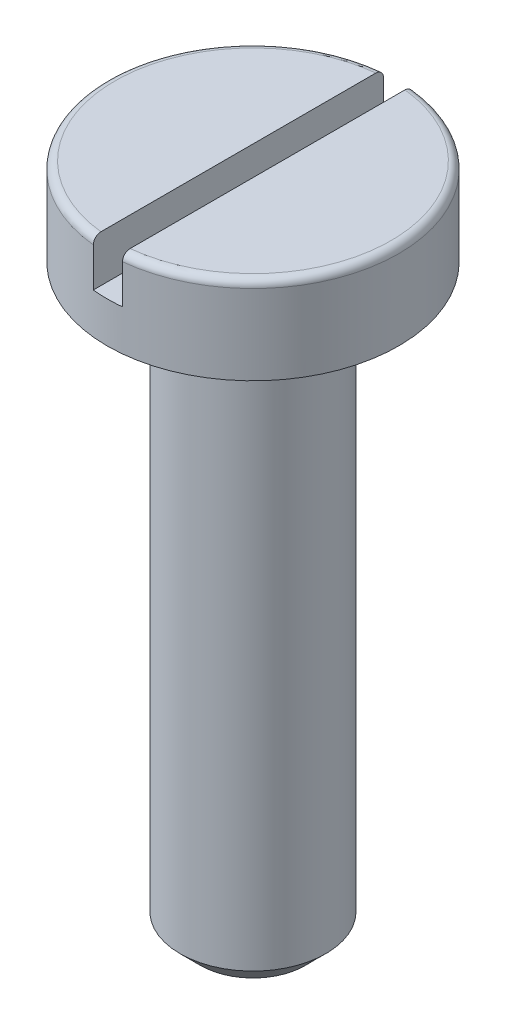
ISO-10303-21;
HEADER;
FILE_DESCRIPTION(('STEP AP214'),'2;1');
FILE_NAME('part.step','',(''),(''),'','','');
FILE_SCHEMA(('AUTOMOTIVE_DESIGN { 1 0 10303 214 1 1 1 1 }'));
ENDSEC;
DATA;
#1=APPLICATION_CONTEXT('core data for automotive mechanical design processes');
#2=APPLICATION_PROTOCOL_DEFINITION('international standard','automotive_design',2000,#1);
#3=PRODUCT_CONTEXT('',#1,'mechanical');
#4=PRODUCT('Part','Part','',(#3));
#5=PRODUCT_RELATED_PRODUCT_CATEGORY('part','',(#4));
#6=PRODUCT_DEFINITION_FORMATION('','',#4);
#7=PRODUCT_DEFINITION_CONTEXT('part definition',#1,'design');
#8=PRODUCT_DEFINITION('design','',#6,#7);
#9=PRODUCT_DEFINITION_SHAPE('','',#8);
#10=(LENGTH_UNIT() NAMED_UNIT(*) SI_UNIT(.MILLI.,.METRE.));
#11=(NAMED_UNIT(*) PLANE_ANGLE_UNIT() SI_UNIT($,.RADIAN.));
#12=(NAMED_UNIT(*) SI_UNIT($,.STERADIAN.) SOLID_ANGLE_UNIT());
#13=UNCERTAINTY_MEASURE_WITH_UNIT(LENGTH_MEASURE(1.E-05),#10,'distance_accuracy_value','');
#14=(GEOMETRIC_REPRESENTATION_CONTEXT(3) GLOBAL_UNCERTAINTY_ASSIGNED_CONTEXT((#13)) GLOBAL_UNIT_ASSIGNED_CONTEXT((#10,
#11,#12)) REPRESENTATION_CONTEXT('',''));
#15=CARTESIAN_POINT('',(0.,0.,0.));
#16=DIRECTION('',(0.,0.,1.));
#17=DIRECTION('',(1.,0.,0.));
#18=AXIS2_PLACEMENT_3D('',#15,#16,#17);
#19=CARTESIAN_POINT('',(0.,1.5,0.));
#20=DIRECTION('',(0.,-1.,0.));
#21=DIRECTION('',(0.,0.,-1.));
#22=AXIS2_PLACEMENT_3D('',#19,#20,#21);
#23=PLANE('',#22);
#24=CARTESIAN_POINT('',(0.,1.5,0.));
#25=DIRECTION('',(0.,1.,0.));
#26=DIRECTION('',(0.,0.,1.));
#27=AXIS2_PLACEMENT_3D('',#24,#25,#26);
#28=CIRCLE('',#27,2.37);
#29=CARTESIAN_POINT('',(-0.25,1.5,-2.35677746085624));
#30=VERTEX_POINT('',#29);
#31=CARTESIAN_POINT('',(-0.25,1.5,2.35677746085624));
#32=VERTEX_POINT('',#31);
#33=EDGE_CURVE('E96',#30,#32,#28,.T.);
#34=ORIENTED_EDGE('',*,*,#33,.T.);
#35=DIRECTION('',(0.,0.,1.));
#36=VECTOR('',#35,1.);
#37=CARTESIAN_POINT('',(-0.25,1.5,-2.5));
#38=LINE('',#37,#36);
#39=EDGE_CURVE('E87',#30,#32,#38,.T.);
#40=ORIENTED_EDGE('',*,*,#39,.F.);
#41=EDGE_LOOP('',(#34,#40));
#42=FACE_BOUND('',#41,.T.);
#43=ADVANCED_FACE('F33',(#42),#23,.F.);
#44=CARTESIAN_POINT('',(0.,1.37,0.));
#45=DIRECTION('',(0.,1.,0.));
#46=DIRECTION('',(0.,0.,1.));
#47=AXIS2_PLACEMENT_3D('',#44,#45,#46);
#48=TOROIDAL_SURFACE('',#47,2.37,0.13);
#49=ORIENTED_EDGE('',*,*,#33,.F.);
#50=CARTESIAN_POINT('',(-0.25,1.43911937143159,-2.46746982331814));
#51=CARTESIAN_POINT('',(-0.25,1.43296494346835,-2.47135281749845));
#52=CARTESIAN_POINT('',(-0.25,1.42647907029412,-2.47472015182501));
#53=CARTESIAN_POINT('',(-0.25,1.41302891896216,-2.48032132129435));
#54=CARTESIAN_POINT('',(-0.25,1.40606409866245,-2.4825538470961));
#55=CARTESIAN_POINT('',(-0.25,1.39186015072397,-2.48581591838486));
#56=CARTESIAN_POINT('',(-0.25,1.38462112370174,-2.48684590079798));
#57=CARTESIAN_POINT('',(-0.25,1.37007485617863,-2.48767352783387));
#58=CARTESIAN_POINT('',(-0.25,1.36276763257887,-2.48747147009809));
#59=CARTESIAN_POINT('',(-0.25,1.34830107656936,-2.48584291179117));
#60=CARTESIAN_POINT('',(-0.25,1.34114155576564,-2.48441808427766));
#61=CARTESIAN_POINT('',(-0.25,1.32716277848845,-2.48038766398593));
#62=CARTESIAN_POINT('',(-0.25,1.32034353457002,-2.47778202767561));
#63=CARTESIAN_POINT('',(-0.25,1.30723188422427,-2.47146272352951));
#64=CARTESIAN_POINT('',(-0.25,1.30093995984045,-2.46774805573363));
#65=CARTESIAN_POINT('',(-0.25,1.28906611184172,-2.45931875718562));
#66=CARTESIAN_POINT('',(-0.25,1.2834841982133,-2.45460411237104));
#67=CARTESIAN_POINT('',(-0.25,1.27316640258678,-2.44429081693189));
#68=CARTESIAN_POINT('',(-0.25,1.26843369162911,-2.43868899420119));
#69=CARTESIAN_POINT('',(-0.25,1.25997030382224,-2.4267736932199));
#70=CARTESIAN_POINT('',(-0.25,1.25623965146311,-2.42046019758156));
#71=CARTESIAN_POINT('',(-0.25,1.24986634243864,-2.40726673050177));
#72=CARTESIAN_POINT('',(-0.25,1.24722926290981,-2.40038406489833));
#73=CARTESIAN_POINT('',(-0.25,1.24314226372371,-2.38627484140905));
#74=CARTESIAN_POINT('',(-0.25,1.24169237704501,-2.37904827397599));
#75=CARTESIAN_POINT('',(-0.25,1.24001521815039,-2.36442203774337));
#76=CARTESIAN_POINT('',(-0.25,1.23979340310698,-2.35702174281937));
#77=CARTESIAN_POINT('',(-0.25,1.24059274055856,-2.34228852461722));
#78=CARTESIAN_POINT('',(-0.25,1.24161391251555,-2.33495560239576));
#79=CARTESIAN_POINT('',(-0.25,1.24487407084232,-2.32055094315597));
#80=CARTESIAN_POINT('',(-0.25,1.24711535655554,-2.31347972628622));
#81=CARTESIAN_POINT('',(-0.25,1.2527552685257,-2.29981484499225));
#82=CARTESIAN_POINT('',(-0.25,1.25615389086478,-2.2932211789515));
#83=CARTESIAN_POINT('',(-0.25,1.26400708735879,-2.28071187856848));
#84=CARTESIAN_POINT('',(-0.25,1.26845980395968,-2.27479507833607));
#85=CARTESIAN_POINT('',(-0.25,1.27829987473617,-2.26379762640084));
#86=CARTESIAN_POINT('',(-0.25,1.28368720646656,-2.25871695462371));
#87=CARTESIAN_POINT('',(-0.25,1.2952158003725,-2.24956319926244));
#88=CARTESIAN_POINT('',(-0.25,1.30135323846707,-2.24548529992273));
#89=CARTESIAN_POINT('',(-0.25,1.31422883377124,-2.23842492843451));
#90=CARTESIAN_POINT('',(-0.25,1.32096697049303,-2.23544241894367));
#91=CARTESIAN_POINT('',(-0.25,1.3348099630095,-2.23067557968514));
#92=CARTESIAN_POINT('',(-0.25,1.34191242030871,-2.22888428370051));
#93=CARTESIAN_POINT('',(-0.25,1.3563176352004,-2.22652489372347));
#94=CARTESIAN_POINT('',(-0.25,1.36362038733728,-2.22595676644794));
#95=CARTESIAN_POINT('',(-0.25,1.37818766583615,-2.22606033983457));
#96=CARTESIAN_POINT('',(-0.25,1.38545222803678,-2.22672707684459));
#97=CARTESIAN_POINT('',(-0.25,1.39976615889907,-2.22927090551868));
#98=CARTESIAN_POINT('',(-0.25,1.40681552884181,-2.23114798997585));
#99=CARTESIAN_POINT('',(-0.25,1.42049920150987,-2.23605713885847));
#100=CARTESIAN_POINT('',(-0.25,1.42713353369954,-2.23908912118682));
#101=CARTESIAN_POINT('',(-0.25,1.43980169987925,-2.24621970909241));
#102=CARTESIAN_POINT('',(-0.25,1.44583552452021,-2.25031833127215));
#103=CARTESIAN_POINT('',(-0.25,1.45715719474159,-2.25948194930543));
#104=CARTESIAN_POINT('',(-0.25,1.46244205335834,-2.26455063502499));
#105=CARTESIAN_POINT('',(-0.25,1.4720918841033,-2.27549874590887));
#106=CARTESIAN_POINT('',(-0.25,1.47645682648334,-2.28137819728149));
#107=CARTESIAN_POINT('',(-0.25,1.48416996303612,-2.29381777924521));
#108=CARTESIAN_POINT('',(-0.25,1.48751205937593,-2.30038169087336));
#109=CARTESIAN_POINT('',(-0.25,1.49305316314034,-2.31397547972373));
#110=CARTESIAN_POINT('',(-0.25,1.49525213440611,-2.32100537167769));
#111=CARTESIAN_POINT('',(-0.25,1.498454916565,-2.33536951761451));
#112=CARTESIAN_POINT('',(-0.25,1.49945266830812,-2.34270512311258));
#113=CARTESIAN_POINT('',(-0.25,1.50020513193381,-2.357439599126));
#114=CARTESIAN_POINT('',(-0.25,1.49995987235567,-2.36483846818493));
#115=CARTESIAN_POINT('',(-0.25,1.49823112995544,-2.37950421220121));
#116=CARTESIAN_POINT('',(-0.25,1.4967453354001,-2.38677081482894));
#117=CARTESIAN_POINT('',(-0.25,1.49257232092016,-2.40095268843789));
#118=CARTESIAN_POINT('',(-0.25,1.48988480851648,-2.40786787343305));
#119=CARTESIAN_POINT('',(-0.25,1.48338728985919,-2.42113804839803));
#120=CARTESIAN_POINT('',(-0.25,1.47957864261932,-2.42749370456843));
#121=CARTESIAN_POINT('',(-0.25,1.47094630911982,-2.43946569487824));
#122=CARTESIAN_POINT('',(-0.25,1.46612387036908,-2.44508292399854));
#123=CARTESIAN_POINT('',(-0.25,1.45756075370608,-2.45349644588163));
#124=CARTESIAN_POINT('',(-0.25,1.45408360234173,-2.45656555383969));
#125=CARTESIAN_POINT('',(-0.25,1.44682221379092,-2.46231606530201));
#126=CARTESIAN_POINT('',(-0.25,1.44303797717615,-2.464997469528));
#127=CARTESIAN_POINT('',(-0.25,1.43911937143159,-2.46746982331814));
#128=B_SPLINE_CURVE_WITH_KNOTS('',3,(#50,#51,#52,#53,#54,#55,#56,#57,#58,#59,#60,#61,#62,#63,
#64,#65,#66,#67,#68,#69,#70,#71,#72,#73,#74,#75,#76,#77,#78,#79,#80,#81,#82,#83,#84,#85,#86,#87,
#88,#89,#90,#91,#92,#93,#94,#95,#96,#97,#98,#99,#100,#101,#102,#103,#104,#105,#106,#107,#108,
#109,#110,#111,#112,#113,#114,#115,#116,#117,#118,#119,#120,#121,#122,#123,#124,#125,#126,#127),
.UNSPECIFIED.,.T.,.F.,(4,2,2,2,2,2,2,2,2,2,2,2,2,2,2,2,2,2,2,2,2,2,2,2,2,2,2,2,2,2,2,2,2,2,2,2,
2,2,4),(0.,0.0218141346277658,0.0436533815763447,0.0654846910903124,0.0873107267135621,
0.109106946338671,0.130903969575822,0.152720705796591,0.174537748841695,0.196434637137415,
0.218332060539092,0.240339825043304,0.262348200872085,0.284454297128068,0.306560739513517,
0.328708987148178,0.350857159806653,0.372966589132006,0.395075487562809,0.417076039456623,
0.439075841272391,0.460945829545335,0.482815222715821,0.504596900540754,0.526378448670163,
0.548158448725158,0.569938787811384,0.591803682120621,0.613669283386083,0.635662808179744,
0.65765702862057,0.679761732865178,0.70186592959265,0.724011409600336,0.746162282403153,
0.768286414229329,0.790383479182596,0.804272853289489,0.818162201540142),.UNSPECIFIED.);
#129=CARTESIAN_POINT('',(-0.25,1.36999999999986,-2.48746859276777));
#130=VERTEX_POINT('',#129);
#131=EDGE_CURVE('E84',#30,#130,#128,.T.);
#132=ORIENTED_EDGE('',*,*,#131,.T.);
#133=CARTESIAN_POINT('',(0.,1.37,0.));
#134=DIRECTION('',(0.,1.,0.));
#135=DIRECTION('',(0.,0.,1.));
#136=AXIS2_PLACEMENT_3D('',#133,#134,#135);
#137=CIRCLE('',#136,2.5);
#138=CARTESIAN_POINT('',(-0.25,1.37000000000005,2.48746859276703));
#139=VERTEX_POINT('',#138);
#140=EDGE_CURVE('E103',#130,#139,#137,.T.);
#141=ORIENTED_EDGE('',*,*,#140,.T.);
#142=CARTESIAN_POINT('',(-0.25,1.42827001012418,2.23988223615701));
#143=CARTESIAN_POINT('',(-0.25,1.42178303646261,2.23660967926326));
#144=CARTESIAN_POINT('',(-0.25,1.41501584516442,2.23388116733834));
#145=CARTESIAN_POINT('',(-0.25,1.40111402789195,2.22959648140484));
#146=CARTESIAN_POINT('',(-0.25,1.39397899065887,2.2280416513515));
#147=CARTESIAN_POINT('',(-0.25,1.37955103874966,2.22615388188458));
#148=CARTESIAN_POINT('',(-0.25,1.37225818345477,2.22582049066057));
#149=CARTESIAN_POINT('',(-0.25,1.35772216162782,2.22638464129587));
#150=CARTESIAN_POINT('',(-0.25,1.35047898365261,2.22728188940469));
#151=CARTESIAN_POINT('',(-0.25,1.33625385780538,2.23027853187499));
#152=CARTESIAN_POINT('',(-0.25,1.32927164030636,2.23237664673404));
#153=CARTESIAN_POINT('',(-0.25,1.31575706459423,2.23771263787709));
#154=CARTESIAN_POINT('',(-0.25,1.30922472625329,2.24095056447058));
#155=CARTESIAN_POINT('',(-0.25,1.2967779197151,2.24848114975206));
#156=CARTESIAN_POINT('',(-0.25,1.29086497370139,2.25277632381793));
#157=CARTESIAN_POINT('',(-0.25,1.27983920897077,2.2622934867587));
#158=CARTESIAN_POINT('',(-0.25,1.27472641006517,2.26751549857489));
#159=CARTESIAN_POINT('',(-0.25,1.26541640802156,2.27876789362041));
#160=CARTESIAN_POINT('',(-0.25,1.26122427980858,2.28480247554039));
#161=CARTESIAN_POINT('',(-0.25,1.25390591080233,2.29748658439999));
#162=CARTESIAN_POINT('',(-0.25,1.25077970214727,2.30413612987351));
#163=CARTESIAN_POINT('',(-0.25,1.24566392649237,2.31790205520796));
#164=CARTESIAN_POINT('',(-0.25,1.24368091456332,2.32502087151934));
#165=CARTESIAN_POINT('',(-0.25,1.24093365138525,2.33948996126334));
#166=CARTESIAN_POINT('',(-0.25,1.2401694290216,2.34684024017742));
#167=CARTESIAN_POINT('',(-0.25,1.2398805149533,2.36159008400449));
#168=CARTESIAN_POINT('',(-0.25,1.24036001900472,2.36898973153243));
#169=CARTESIAN_POINT('',(-0.25,1.24255472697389,2.3836035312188));
#170=CARTESIAN_POINT('',(-0.25,1.24426993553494,2.39081768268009));
#171=CARTESIAN_POINT('',(-0.25,1.24888858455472,2.40485327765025));
#172=CARTESIAN_POINT('',(-0.25,1.25179174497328,2.41167481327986));
#173=CARTESIAN_POINT('',(-0.25,1.25870596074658,2.4247312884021));
#174=CARTESIAN_POINT('',(-0.25,1.26271699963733,2.43096623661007));
#175=CARTESIAN_POINT('',(-0.25,1.27171897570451,2.44264879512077));
#176=CARTESIAN_POINT('',(-0.25,1.27670646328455,2.448099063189));
#177=CARTESIAN_POINT('',(-0.25,1.28752981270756,2.45807967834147));
#178=CARTESIAN_POINT('',(-0.25,1.29336565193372,2.46261004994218));
#179=CARTESIAN_POINT('',(-0.25,1.30568850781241,2.47059795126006));
#180=CARTESIAN_POINT('',(-0.25,1.31217209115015,2.47406077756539));
#181=CARTESIAN_POINT('',(-0.25,1.32563049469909,2.47984309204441));
#182=CARTESIAN_POINT('',(-0.25,1.33260530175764,2.48216261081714));
#183=CARTESIAN_POINT('',(-0.25,1.34681431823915,2.48558233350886));
#184=CARTESIAN_POINT('',(-0.25,1.35404721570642,2.48668799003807));
#185=CARTESIAN_POINT('',(-0.25,1.36859587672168,2.48766627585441));
#186=CARTESIAN_POINT('',(-0.25,1.37591163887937,2.48753892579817));
#187=CARTESIAN_POINT('',(-0.25,1.39040100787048,2.48605665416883));
#188=CARTESIAN_POINT('',(-0.25,1.39757489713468,2.48470449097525));
#189=CARTESIAN_POINT('',(-0.25,1.41159411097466,2.48081590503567));
#190=CARTESIAN_POINT('',(-0.25,1.41843943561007,2.47827948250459));
#191=CARTESIAN_POINT('',(-0.25,1.43161392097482,2.47209342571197));
#192=CARTESIAN_POINT('',(-0.25,1.43794264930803,2.46844287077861));
#193=CARTESIAN_POINT('',(-0.25,1.44990025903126,2.46013466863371));
#194=CARTESIAN_POINT('',(-0.25,1.4555291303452,2.45547700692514));
#195=CARTESIAN_POINT('',(-0.25,1.4659494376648,2.44526952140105));
#196=CARTESIAN_POINT('',(-0.25,1.47073779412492,2.43971655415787));
#197=CARTESIAN_POINT('',(-0.25,1.47931984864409,2.42788895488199));
#198=CARTESIAN_POINT('',(-0.25,1.4831135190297,2.42161430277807));
#199=CARTESIAN_POINT('',(-0.25,1.48961873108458,2.40848775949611));
#200=CARTESIAN_POINT('',(-0.25,1.49232474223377,2.40163312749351));
#201=CARTESIAN_POINT('',(-0.25,1.49655338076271,2.38756806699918));
#202=CARTESIAN_POINT('',(-0.25,1.49807597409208,2.38035762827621));
#203=CARTESIAN_POINT('',(-0.25,1.49990072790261,2.36575085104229));
#204=CARTESIAN_POINT('',(-0.25,1.50019735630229,2.35835382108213));
#205=CARTESIAN_POINT('',(-0.25,1.49954724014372,2.34361481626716));
#206=CARTESIAN_POINT('',(-0.25,1.49860052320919,2.33627284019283));
#207=CARTESIAN_POINT('',(-0.25,1.49548711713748,2.32183769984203));
#208=CARTESIAN_POINT('',(-0.25,1.49331813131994,2.31474503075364));
#209=CARTESIAN_POINT('',(-0.25,1.48781759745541,2.30102344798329));
#210=CARTESIAN_POINT('',(-0.25,1.48448576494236,2.29439464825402));
#211=CARTESIAN_POINT('',(-0.25,1.47675756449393,2.28180103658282));
#212=CARTESIAN_POINT('',(-0.25,1.47236243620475,2.27583546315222));
#213=CARTESIAN_POINT('',(-0.25,1.46263145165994,2.26473715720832));
#214=CARTESIAN_POINT('',(-0.25,1.45729675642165,2.25960341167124));
#215=CARTESIAN_POINT('',(-0.25,1.44797002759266,2.25204072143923));
#216=CARTESIAN_POINT('',(-0.25,1.44421445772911,2.24931504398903));
#217=CARTESIAN_POINT('',(-0.25,1.43643395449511,2.24427982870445));
#218=CARTESIAN_POINT('',(-0.25,1.43240902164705,2.24197029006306));
#219=CARTESIAN_POINT('',(-0.25,1.42827001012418,2.23988223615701));
#220=B_SPLINE_CURVE_WITH_KNOTS('',3,(#142,#143,#144,#145,#146,#147,#148,#149,#150,#151,#152,
#153,#154,#155,#156,#157,#158,#159,#160,#161,#162,#163,#164,#165,#166,#167,#168,#169,#170,#171,
#172,#173,#174,#175,#176,#177,#178,#179,#180,#181,#182,#183,#184,#185,#186,#187,#188,#189,#190,
#191,#192,#193,#194,#195,#196,#197,#198,#199,#200,#201,#202,#203,#204,#205,#206,#207,#208,#209,
#210,#211,#212,#213,#214,#215,#216,#217,#218,#219),.UNSPECIFIED.,.T.,.F.,(4,2,2,2,2,2,2,2,2,2,2,
2,2,2,2,2,2,2,2,2,2,2,2,2,2,2,2,2,2,2,2,2,2,2,2,2,2,2,4),(0.,0.0217802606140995,
0.0435854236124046,0.0653825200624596,0.0871744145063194,0.108943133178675,0.130712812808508,
0.152534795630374,0.17435731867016,0.196297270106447,0.218237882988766,0.240303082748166,
0.262368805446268,0.284509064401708,0.306649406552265,0.328784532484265,0.350919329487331,
0.372977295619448,0.395034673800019,0.416980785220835,0.438926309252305,0.460772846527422,
0.48261901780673,0.504416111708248,0.526213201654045,0.548028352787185,0.569843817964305,
0.591737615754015,0.61363202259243,0.635636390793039,0.657641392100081,0.679745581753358,
0.701849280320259,0.723994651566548,0.746145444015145,0.76827053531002,0.790368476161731,
0.804265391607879,0.818162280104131),.UNSPECIFIED.);
#221=EDGE_CURVE('E93',#139,#32,#220,.T.);
#222=ORIENTED_EDGE('',*,*,#221,.T.);
#223=EDGE_LOOP('',(#49,#132,#141,#222));
#224=FACE_BOUND('',#223,.T.);
#225=ADVANCED_FACE('F99',(#224),#48,.T.);
#226=CARTESIAN_POINT('',(0.,-10.,0.));
#227=DIRECTION('',(0.,1.,0.));
#228=DIRECTION('',(0.,0.,1.));
#229=AXIS2_PLACEMENT_3D('',#226,#227,#228);
#230=CYLINDRICAL_SURFACE('',#229,1.25);
#231=CARTESIAN_POINT('',(0.,-9.64999999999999,0.));
#232=DIRECTION('',(0.,1.,0.));
#233=DIRECTION('',(0.,0.,1.));
#234=AXIS2_PLACEMENT_3D('',#231,#232,#233);
#235=CIRCLE('',#234,1.25);
#236=CARTESIAN_POINT('',(0.,-9.64999999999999,1.25));
#237=VERTEX_POINT('',#236);
#238=EDGE_CURVE('E116',#237,#237,#235,.T.);
#239=ORIENTED_EDGE('',*,*,#238,.T.);
#240=EDGE_LOOP('',(#239));
#241=FACE_BOUND('',#240,.T.);
#242=CARTESIAN_POINT('',(0.,0.,0.));
#243=DIRECTION('',(0.,1.,0.));
#244=DIRECTION('',(0.,0.,1.));
#245=AXIS2_PLACEMENT_3D('',#242,#243,#244);
#246=CIRCLE('',#245,1.25);
#247=CARTESIAN_POINT('',(0.,0.,1.25));
#248=VERTEX_POINT('',#247);
#249=EDGE_CURVE('E113',#248,#248,#246,.T.);
#250=ORIENTED_EDGE('',*,*,#249,.F.);
#251=EDGE_LOOP('',(#250));
#252=FACE_BOUND('',#251,.T.);
#253=ADVANCED_FACE('F184',(#241,#252),#230,.T.);
#254=CARTESIAN_POINT('',(0.,-10.,0.));
#255=DIRECTION('',(0.,1.,0.));
#256=DIRECTION('',(0.,0.,1.));
#257=AXIS2_PLACEMENT_3D('',#254,#255,#256);
#258=PLANE('',#257);
#259=CARTESIAN_POINT('',(0.,-10.,0.));
#260=DIRECTION('',(0.,1.,0.));
#261=DIRECTION('',(0.,0.,1.));
#262=AXIS2_PLACEMENT_3D('',#259,#260,#261);
#263=CIRCLE('',#262,0.899999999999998);
#264=CARTESIAN_POINT('',(0.,-10.,0.899999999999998));
#265=VERTEX_POINT('',#264);
#266=EDGE_CURVE('E119',#265,#265,#263,.F.);
#267=ORIENTED_EDGE('',*,*,#266,.T.);
#268=EDGE_LOOP('',(#267));
#269=FACE_BOUND('',#268,.T.);
#270=ADVANCED_FACE('F194',(#269),#258,.F.);
#271=CARTESIAN_POINT('',(0.,-9.64999999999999,0.));
#272=DIRECTION('',(0.,1.,0.));
#273=DIRECTION('',(0.,0.,1.));
#274=AXIS2_PLACEMENT_3D('',#271,#272,#273);
#275=CONICAL_SURFACE('',#274,1.25,0.785398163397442);
#276=ORIENTED_EDGE('',*,*,#266,.F.);
#277=EDGE_LOOP('',(#276));
#278=FACE_BOUND('',#277,.T.);
#279=ORIENTED_EDGE('',*,*,#238,.F.);
#280=EDGE_LOOP('',(#279));
#281=FACE_BOUND('',#280,.T.);
#282=ADVANCED_FACE('F35',(#278,#281),#275,.T.);
#283=CARTESIAN_POINT('',(0.25,1.5,2.35677746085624));
#284=VERTEX_POINT('',#283);
#285=CARTESIAN_POINT('',(0.25,1.5,-2.35677746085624));
#286=VERTEX_POINT('',#285);
#287=EDGE_CURVE('E100',#284,#286,#28,.T.);
#288=ORIENTED_EDGE('',*,*,#287,.T.);
#289=DIRECTION('',(0.,0.,-1.));
#290=VECTOR('',#289,1.);
#291=CARTESIAN_POINT('',(0.25,1.5,-2.5));
#292=LINE('',#291,#290);
#293=EDGE_CURVE('E97',#284,#286,#292,.T.);
#294=ORIENTED_EDGE('',*,*,#293,.F.);
#295=EDGE_LOOP('',(#288,#294));
#296=FACE_BOUND('',#295,.T.);
#297=ADVANCED_FACE('F158',(#296),#23,.F.);
#298=CARTESIAN_POINT('',(0.,0.,0.));
#299=DIRECTION('',(0.,1.,0.));
#300=DIRECTION('',(0.,0.,1.));
#301=AXIS2_PLACEMENT_3D('',#298,#299,#300);
#302=PLANE('',#301);
#303=ORIENTED_EDGE('',*,*,#249,.T.);
#304=EDGE_LOOP('',(#303));
#305=FACE_BOUND('',#304,.T.);
#306=CARTESIAN_POINT('',(0.,0.,0.));
#307=DIRECTION('',(0.,1.,0.));
#308=DIRECTION('',(0.,0.,1.));
#309=AXIS2_PLACEMENT_3D('',#306,#307,#308);
#310=CIRCLE('',#309,2.5);
#311=CARTESIAN_POINT('',(0.,0.,2.5));
#312=VERTEX_POINT('',#311);
#313=EDGE_CURVE('E110',#312,#312,#310,.T.);
#314=ORIENTED_EDGE('',*,*,#313,.F.);
#315=EDGE_LOOP('',(#314));
#316=FACE_BOUND('',#315,.T.);
#317=ADVANCED_FACE('F188',(#305,#316),#302,.F.);
#318=CARTESIAN_POINT('',(0.,1.3,0.));
#319=DIRECTION('',(0.,1.,0.));
#320=DIRECTION('',(0.,0.,1.));
#321=AXIS2_PLACEMENT_3D('',#318,#319,#320);
#322=CYLINDRICAL_SURFACE('',#321,2.5);
#323=ORIENTED_EDGE('',*,*,#140,.F.);
#324=DIRECTION('',(0.,1.,0.));
#325=VECTOR('',#324,1.);
#326=CARTESIAN_POINT('',(-0.25,1.3,-2.48746859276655));
#327=LINE('',#326,#325);
#328=CARTESIAN_POINT('',(-0.25,0.7,-2.48746859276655));
#329=VERTEX_POINT('',#328);
#330=EDGE_CURVE('E56',#130,#329,#327,.F.);
#331=ORIENTED_EDGE('',*,*,#330,.T.);
#332=CARTESIAN_POINT('',(0.,0.7,0.));
#333=DIRECTION('',(0.,1.,0.));
#334=DIRECTION('',(0.,0.,1.));
#335=AXIS2_PLACEMENT_3D('',#332,#333,#334);
#336=CIRCLE('',#335,2.5);
#337=CARTESIAN_POINT('',(0.25,0.7,-2.48746859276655));
#338=VERTEX_POINT('',#337);
#339=EDGE_CURVE('E11',#338,#329,#336,.T.);
#340=ORIENTED_EDGE('',*,*,#339,.F.);
#341=DIRECTION('',(0.,1.,0.));
#342=VECTOR('',#341,1.);
#343=CARTESIAN_POINT('',(0.25,1.3,-2.48746859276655));
#344=LINE('',#343,#342);
#345=CARTESIAN_POINT('',(0.25,1.37,-2.48746859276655));
#346=VERTEX_POINT('',#345);
#347=EDGE_CURVE('E167',#338,#346,#344,.T.);
#348=ORIENTED_EDGE('',*,*,#347,.T.);
#349=CARTESIAN_POINT('',(0.25,1.37,2.48746859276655));
#350=VERTEX_POINT('',#349);
#351=EDGE_CURVE('E109',#350,#346,#137,.T.);
#352=ORIENTED_EDGE('',*,*,#351,.F.);
#353=DIRECTION('',(0.,1.,0.));
#354=VECTOR('',#353,1.);
#355=CARTESIAN_POINT('',(0.25,1.3,2.48746859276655));
#356=LINE('',#355,#354);
#357=CARTESIAN_POINT('',(0.25,0.7,2.48746859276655));
#358=VERTEX_POINT('',#357);
#359=EDGE_CURVE('E48',#350,#358,#356,.F.);
#360=ORIENTED_EDGE('',*,*,#359,.T.);
#361=CARTESIAN_POINT('',(-0.25,0.7,2.48746859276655));
#362=VERTEX_POINT('',#361);
#363=EDGE_CURVE('E37',#362,#358,#336,.T.);
#364=ORIENTED_EDGE('',*,*,#363,.F.);
#365=DIRECTION('',(0.,1.,0.));
#366=VECTOR('',#365,1.);
#367=CARTESIAN_POINT('',(-0.25,1.3,2.48746859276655));
#368=LINE('',#367,#366);
#369=EDGE_CURVE('E104',#362,#139,#368,.T.);
#370=ORIENTED_EDGE('',*,*,#369,.T.);
#371=EDGE_LOOP('',(#323,#331,#340,#348,#352,#360,#364,#370));
#372=FACE_BOUND('',#371,.T.);
#373=ORIENTED_EDGE('',*,*,#313,.T.);
#374=EDGE_LOOP('',(#373));
#375=FACE_BOUND('',#374,.T.);
#376=ADVANCED_FACE('F171',(#372,#375),#322,.T.);
#377=ORIENTED_EDGE('',*,*,#351,.T.);
#378=CARTESIAN_POINT('',(0.25,1.43911937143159,-2.46746982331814));
#379=CARTESIAN_POINT('',(0.25,1.44531290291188,-2.4635613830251));
#380=CARTESIAN_POINT('',(0.25,1.45117973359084,-2.45912493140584));
#381=CARTESIAN_POINT('',(0.25,1.46208885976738,-2.44932494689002));
#382=CARTESIAN_POINT('',(0.25,1.46713010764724,-2.44396025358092));
#383=CARTESIAN_POINT('',(0.25,1.47623837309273,-2.43246478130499));
#384=CARTESIAN_POINT('',(0.25,1.48030606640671,-2.42633453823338));
#385=CARTESIAN_POINT('',(0.25,1.48735776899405,-2.41348197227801));
#386=CARTESIAN_POINT('',(0.25,1.49034204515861,-2.40675979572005));
#387=CARTESIAN_POINT('',(0.25,1.49515638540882,-2.39288535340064));
#388=CARTESIAN_POINT('',(0.25,1.49698200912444,-2.38573154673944));
#389=CARTESIAN_POINT('',(0.25,1.49941139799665,-2.37121906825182));
#390=CARTESIAN_POINT('',(0.25,1.50001508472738,-2.36386038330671));
#391=CARTESIAN_POINT('',(0.25,1.49998428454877,-2.3491179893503));
#392=CARTESIAN_POINT('',(0.25,1.49934515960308,-2.34173428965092));
#393=CARTESIAN_POINT('',(0.25,1.49683735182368,-2.32717865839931));
#394=CARTESIAN_POINT('',(0.25,1.49496865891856,-2.3200067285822));
#395=CARTESIAN_POINT('',(0.25,1.490051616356,-2.3060736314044));
#396=CARTESIAN_POINT('',(0.25,1.48700245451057,-2.29931275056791));
#397=CARTESIAN_POINT('',(0.25,1.47980910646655,-2.28640093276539));
#398=CARTESIAN_POINT('',(0.25,1.47566493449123,-2.28024998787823));
#399=CARTESIAN_POINT('',(0.25,1.46641129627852,-2.26875323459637));
#400=CARTESIAN_POINT('',(0.25,1.46130474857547,-2.26340507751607));
#401=CARTESIAN_POINT('',(0.25,1.45026180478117,-2.25364782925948));
#402=CARTESIAN_POINT('',(0.25,1.44432543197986,-2.24923871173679));
#403=CARTESIAN_POINT('',(0.25,1.43182649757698,-2.24151111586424));
#404=CARTESIAN_POINT('',(0.25,1.42526759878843,-2.23818671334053));
#405=CARTESIAN_POINT('',(0.25,1.41168257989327,-2.23269332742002));
#406=CARTESIAN_POINT('',(0.25,1.40465647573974,-2.23052430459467));
#407=CARTESIAN_POINT('',(0.25,1.39037852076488,-2.22741492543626));
#408=CARTESIAN_POINT('',(0.25,1.38312814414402,-2.22646779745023));
#409=CARTESIAN_POINT('',(0.25,1.36857150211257,-2.22580800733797));
#410=CARTESIAN_POINT('',(0.25,1.36126523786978,-2.22609531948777));
#411=CARTESIAN_POINT('',(0.25,1.3468256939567,-2.22789329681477));
#412=CARTESIAN_POINT('',(0.25,1.33969198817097,-2.22940054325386));
#413=CARTESIAN_POINT('',(0.25,1.32577834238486,-2.23358966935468));
#414=CARTESIAN_POINT('',(0.25,1.3189984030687,-2.23627155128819));
#415=CARTESIAN_POINT('',(0.25,1.30597364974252,-2.24273619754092));
#416=CARTESIAN_POINT('',(0.25,1.29972960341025,-2.2465205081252));
#417=CARTESIAN_POINT('',(0.25,1.28796144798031,-2.25507891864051));
#418=CARTESIAN_POINT('',(0.25,1.28243735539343,-2.25985304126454));
#419=CARTESIAN_POINT('',(0.25,1.27223671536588,-2.27027985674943));
#420=CARTESIAN_POINT('',(0.25,1.26756441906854,-2.27593670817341));
#421=CARTESIAN_POINT('',(0.25,1.25922921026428,-2.2879506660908));
#422=CARTESIAN_POINT('',(0.25,1.25556632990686,-2.29430779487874));
#423=CARTESIAN_POINT('',(0.25,1.2493316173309,-2.30758200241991));
#424=CARTESIAN_POINT('',(0.25,1.24676632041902,-2.31450215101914));
#425=CARTESIAN_POINT('',(0.25,1.24282849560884,-2.32867390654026));
#426=CARTESIAN_POINT('',(0.25,1.24145599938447,-2.33592552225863));
#427=CARTESIAN_POINT('',(0.25,1.23993838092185,-2.3505865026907));
#428=CARTESIAN_POINT('',(0.25,1.23979835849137,-2.35799639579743));
#429=CARTESIAN_POINT('',(0.25,1.24076330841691,-2.37273473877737));
#430=CARTESIAN_POINT('',(0.25,1.24186829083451,-2.38006318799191));
#431=CARTESIAN_POINT('',(0.25,1.24529448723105,-2.39443552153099));
#432=CARTESIAN_POINT('',(0.25,1.24761653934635,-2.40147920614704));
#433=CARTESIAN_POINT('',(0.25,1.25341345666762,-2.41507516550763));
#434=CARTESIAN_POINT('',(0.25,1.25688831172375,-2.42162744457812));
#435=CARTESIAN_POINT('',(0.25,1.264882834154,-2.43403436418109));
#436=CARTESIAN_POINT('',(0.25,1.26939956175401,-2.43989089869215));
#437=CARTESIAN_POINT('',(0.25,1.27935653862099,-2.45075789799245));
#438=CARTESIAN_POINT('',(0.25,1.28479676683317,-2.4557683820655));
#439=CARTESIAN_POINT('',(0.25,1.29641830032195,-2.46477503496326));
#440=CARTESIAN_POINT('',(0.25,1.30259589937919,-2.46877598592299));
#441=CARTESIAN_POINT('',(0.25,1.3155374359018,-2.47567791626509));
#442=CARTESIAN_POINT('',(0.25,1.32230133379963,-2.47857896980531));
#443=CARTESIAN_POINT('',(0.25,1.33618770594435,-2.48318462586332));
#444=CARTESIAN_POINT('',(0.25,1.34330824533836,-2.48489506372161));
#445=CARTESIAN_POINT('',(0.25,1.35773763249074,-2.48709264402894));
#446=CARTESIAN_POINT('',(0.25,1.36504652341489,-2.48757950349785));
#447=CARTESIAN_POINT('',(0.25,1.37962324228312,-2.4873155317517));
#448=CARTESIAN_POINT('',(0.25,1.38689112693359,-2.48656772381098));
#449=CARTESIAN_POINT('',(0.25,1.40119172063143,-2.48386209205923));
#450=CARTESIAN_POINT('',(0.25,1.40822470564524,-2.48190574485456));
#451=CARTESIAN_POINT('',(0.25,1.41924547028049,-2.47781537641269));
#452=CARTESIAN_POINT('',(0.25,1.42336845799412,-2.4760359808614));
#453=CARTESIAN_POINT('',(0.25,1.43140829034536,-2.47206038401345));
#454=CARTESIAN_POINT('',(0.25,1.43532513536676,-2.46986418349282));
#455=CARTESIAN_POINT('',(0.25,1.43911937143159,-2.46746982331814));
#456=B_SPLINE_CURVE_WITH_KNOTS('',3,(#378,#379,#380,#381,#382,#383,#384,#385,#386,#387,#388,
#389,#390,#391,#392,#393,#394,#395,#396,#397,#398,#399,#400,#401,#402,#403,#404,#405,#406,#407,
#408,#409,#410,#411,#412,#413,#414,#415,#416,#417,#418,#419,#420,#421,#422,#423,#424,#425,#426,
#427,#428,#429,#430,#431,#432,#433,#434,#435,#436,#437,#438,#439,#440,#441,#442,#443,#444,#445,
#446,#447,#448,#449,#450,#451,#452,#453,#454,#455),.UNSPECIFIED.,.T.,.F.,(4,2,2,2,2,2,2,2,2,2,2,
2,2,2,2,2,2,2,2,2,2,2,2,2,2,2,2,2,2,2,2,2,2,2,2,2,2,2,4),(0.,0.0219544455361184,
0.0439365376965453,0.0659033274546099,0.0878647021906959,0.109909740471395,0.131956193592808,
0.154085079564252,0.176214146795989,0.19835846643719,0.22050249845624,0.242580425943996,
0.264657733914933,0.286612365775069,0.308566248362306,0.330397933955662,0.352229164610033,
0.373999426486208,0.395769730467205,0.417570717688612,0.43937220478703,0.461279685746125,
0.483187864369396,0.505224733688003,0.527262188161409,0.549390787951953,0.571519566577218,
0.593663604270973,0.615807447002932,0.637889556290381,0.659971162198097,0.681946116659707,
0.703919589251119,0.725784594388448,0.747654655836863,0.769471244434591,0.791261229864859,
0.804710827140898,0.818160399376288),.UNSPECIFIED.);
#457=EDGE_CURVE('E128',#346,#286,#456,.T.);
#458=ORIENTED_EDGE('',*,*,#457,.T.);
#459=ORIENTED_EDGE('',*,*,#287,.F.);
#460=CARTESIAN_POINT('',(0.25,1.42827001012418,2.23988223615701));
#461=CARTESIAN_POINT('',(0.25,1.43480328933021,2.24317888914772));
#462=CARTESIAN_POINT('',(0.25,1.44106182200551,2.24703226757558));
#463=CARTESIAN_POINT('',(0.25,1.45284696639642,2.25574000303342));
#464=CARTESIAN_POINT('',(0.25,1.45837264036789,2.2605956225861));
#465=CARTESIAN_POINT('',(0.25,1.4685279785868,2.27116134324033));
#466=CARTESIAN_POINT('',(0.25,1.47315829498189,2.27687081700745));
#467=CARTESIAN_POINT('',(0.25,1.48139817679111,2.28898159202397));
#468=CARTESIAN_POINT('',(0.25,1.48500799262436,2.2953827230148));
#469=CARTESIAN_POINT('',(0.25,1.49112338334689,2.30872636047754));
#470=CARTESIAN_POINT('',(0.25,1.49362405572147,2.31567111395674));
#471=CARTESIAN_POINT('',(0.25,1.49742942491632,2.3298812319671));
#472=CARTESIAN_POINT('',(0.25,1.49873404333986,2.33714661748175));
#473=CARTESIAN_POINT('',(0.25,1.50011402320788,2.35182294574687));
#474=CARTESIAN_POINT('',(0.25,1.50018439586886,2.35923435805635));
#475=CARTESIAN_POINT('',(0.25,1.49908074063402,2.37396400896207));
#476=CARTESIAN_POINT('',(0.25,1.49790670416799,2.38128224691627));
#477=CARTESIAN_POINT('',(0.25,1.4943450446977,2.39562189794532));
#478=CARTESIAN_POINT('',(0.25,1.49195670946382,2.4026431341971));
#479=CARTESIAN_POINT('',(0.25,1.48603186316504,2.416183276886));
#480=CARTESIAN_POINT('',(0.25,1.48249536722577,2.42270218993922));
#481=CARTESIAN_POINT('',(0.25,1.47438445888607,2.43503198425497));
#482=CARTESIAN_POINT('',(0.25,1.46981305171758,2.44084484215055));
#483=CARTESIAN_POINT('',(0.25,1.45975484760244,2.45161585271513));
#484=CARTESIAN_POINT('',(0.25,1.45426807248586,2.45657402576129));
#485=CARTESIAN_POINT('',(0.25,1.44256343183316,2.46546896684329));
#486=CARTESIAN_POINT('',(0.25,1.43634926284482,2.46941059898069));
#487=CARTESIAN_POINT('',(0.25,1.42334490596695,2.47618877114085));
#488=CARTESIAN_POINT('',(0.25,1.41655473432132,2.47902534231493));
#489=CARTESIAN_POINT('',(0.25,1.40262620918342,2.48349918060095));
#490=CARTESIAN_POINT('',(0.25,1.39548968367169,2.485142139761));
#491=CARTESIAN_POINT('',(0.25,1.38104190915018,2.4872027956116));
#492=CARTESIAN_POINT('',(0.25,1.37373066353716,2.48762051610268));
#493=CARTESIAN_POINT('',(0.25,1.35916318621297,2.48721905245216));
#494=CARTESIAN_POINT('',(0.25,1.35190685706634,2.48640339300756));
#495=CARTESIAN_POINT('',(0.25,1.33763417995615,2.48356551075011));
#496=CARTESIAN_POINT('',(0.25,1.33061783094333,2.48154329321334));
#497=CARTESIAN_POINT('',(0.25,1.31702265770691,2.4763508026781));
#498=CARTESIAN_POINT('',(0.25,1.31044389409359,2.47318037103));
#499=CARTESIAN_POINT('',(0.25,1.2979098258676,2.46578325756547));
#500=CARTESIAN_POINT('',(0.25,1.29195452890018,2.46155656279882));
#501=CARTESIAN_POINT('',(0.25,1.28081627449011,2.45215381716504));
#502=CARTESIAN_POINT('',(0.25,1.27563574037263,2.44697489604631));
#503=CARTESIAN_POINT('',(0.25,1.26621257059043,2.43582452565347));
#504=CARTESIAN_POINT('',(0.25,1.26196995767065,2.4298530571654));
#505=CARTESIAN_POINT('',(0.25,1.25452094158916,2.417256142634));
#506=CARTESIAN_POINT('',(0.25,1.25131967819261,2.41062765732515));
#507=CARTESIAN_POINT('',(0.25,1.24606935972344,2.39692908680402));
#508=CARTESIAN_POINT('',(0.25,1.24402033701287,2.38985898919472));
#509=CARTESIAN_POINT('',(0.25,1.24112311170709,2.37544159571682));
#510=CARTESIAN_POINT('',(0.25,1.24028070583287,2.36809313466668));
#511=CARTESIAN_POINT('',(0.25,1.23983791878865,2.35335884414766));
#512=CARTESIAN_POINT('',(0.25,1.24023756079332,2.3459730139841));
#513=CARTESIAN_POINT('',(0.25,1.24227036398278,2.33135279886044));
#514=CARTESIAN_POINT('',(0.25,1.24390682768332,2.32411887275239));
#515=CARTESIAN_POINT('',(0.25,1.24837191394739,2.31002868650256));
#516=CARTESIAN_POINT('',(0.25,1.25120054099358,2.30317242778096));
#517=CARTESIAN_POINT('',(0.25,1.25796880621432,2.29003909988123));
#518=CARTESIAN_POINT('',(0.25,1.26190753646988,2.28376156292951));
#519=CARTESIAN_POINT('',(0.25,1.27078722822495,2.27196046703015));
#520=CARTESIAN_POINT('',(0.25,1.27572817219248,2.26643689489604));
#521=CARTESIAN_POINT('',(0.25,1.28645035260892,2.25632637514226));
#522=CARTESIAN_POINT('',(0.25,1.29222793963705,2.25173555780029));
#523=CARTESIAN_POINT('',(0.25,1.3044754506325,2.24359610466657));
#524=CARTESIAN_POINT('',(0.25,1.31094532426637,2.24004739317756));
#525=CARTESIAN_POINT('',(0.25,1.32435209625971,2.2341150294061));
#526=CARTESIAN_POINT('',(0.25,1.33128594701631,2.23172448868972));
#527=CARTESIAN_POINT('',(0.25,1.34545952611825,2.22814716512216));
#528=CARTESIAN_POINT('',(0.25,1.35269932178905,2.22696064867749));
#529=CARTESIAN_POINT('',(0.25,1.36724346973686,2.22582979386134));
#530=CARTESIAN_POINT('',(0.25,1.37454741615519,2.22588019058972));
#531=CARTESIAN_POINT('',(0.25,1.38903647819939,2.22720915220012));
#532=CARTESIAN_POINT('',(0.25,1.39622172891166,2.2284862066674));
#533=CARTESIAN_POINT('',(0.25,1.40756582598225,2.23150514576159));
#534=CARTESIAN_POINT('',(0.25,1.41182600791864,2.23287947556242));
#535=CARTESIAN_POINT('',(0.25,1.4201816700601,2.23606063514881));
#536=CARTESIAN_POINT('',(0.25,1.42427715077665,2.23786746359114));
#537=CARTESIAN_POINT('',(0.25,1.42827001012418,2.23988223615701));
#538=B_SPLINE_CURVE_WITH_KNOTS('',3,(#460,#461,#462,#463,#464,#465,#466,#467,#468,#469,#470,
#471,#472,#473,#474,#475,#476,#477,#478,#479,#480,#481,#482,#483,#484,#485,#486,#487,#488,#489,
#490,#491,#492,#493,#494,#495,#496,#497,#498,#499,#500,#501,#502,#503,#504,#505,#506,#507,#508,
#509,#510,#511,#512,#513,#514,#515,#516,#517,#518,#519,#520,#521,#522,#523,#524,#525,#526,#527,
#528,#529,#530,#531,#532,#533,#534,#535,#536,#537),.UNSPECIFIED.,.T.,.F.,(4,2,2,2,2,2,2,2,2,2,2,
2,2,2,2,2,2,2,2,2,2,2,2,2,2,2,2,2,2,2,2,2,2,2,2,2,2,2,4),(0.,0.021937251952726,
0.0439023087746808,0.0658513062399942,0.0877949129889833,0.10983456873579,0.1318756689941,
0.15400583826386,0.176136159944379,0.198279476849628,0.220422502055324,0.242502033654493,
0.264581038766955,0.2865523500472,0.308523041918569,0.330388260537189,0.352253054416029,
0.374055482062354,0.395857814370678,0.417663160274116,0.439468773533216,0.461341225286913,
0.483214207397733,0.505193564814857,0.527173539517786,0.549258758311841,0.571344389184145,
0.593489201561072,0.615634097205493,0.637760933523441,0.659887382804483,0.681920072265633,
0.703951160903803,0.725849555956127,0.747752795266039,0.76956282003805,0.791346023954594,
0.804753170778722,0.818160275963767),.UNSPECIFIED.);
#539=EDGE_CURVE('E122',#284,#350,#538,.T.);
#540=ORIENTED_EDGE('',*,*,#539,.T.);
#541=EDGE_LOOP('',(#377,#458,#459,#540));
#542=FACE_BOUND('',#541,.T.);
#543=ADVANCED_FACE('F132',(#542),#48,.T.);
#544=CARTESIAN_POINT('',(-0.25,0.7,2.5));
#545=DIRECTION('',(0.,1.,0.));
#546=DIRECTION('',(0.,0.,1.));
#547=AXIS2_PLACEMENT_3D('',#544,#545,#546);
#548=PLANE('',#547);
#549=DIRECTION('',(0.,0.,-1.));
#550=VECTOR('',#549,1.);
#551=CARTESIAN_POINT('',(0.25,0.7,-2.5));
#552=LINE('',#551,#550);
#553=EDGE_CURVE('E162',#358,#338,#552,.T.);
#554=ORIENTED_EDGE('',*,*,#553,.T.);
#555=ORIENTED_EDGE('',*,*,#339,.T.);
#556=DIRECTION('',(0.,0.,1.));
#557=VECTOR('',#556,1.);
#558=CARTESIAN_POINT('',(-0.25,0.7,-2.5));
#559=LINE('',#558,#557);
#560=EDGE_CURVE('E159',#329,#362,#559,.T.);
#561=ORIENTED_EDGE('',*,*,#560,.T.);
#562=ORIENTED_EDGE('',*,*,#363,.T.);
#563=EDGE_LOOP('',(#554,#555,#561,#562));
#564=FACE_BOUND('',#563,.T.);
#565=ADVANCED_FACE('F140',(#564),#548,.T.);
#566=CARTESIAN_POINT('',(-0.25,0.7,-2.5));
#567=DIRECTION('',(-1.,0.,0.));
#568=DIRECTION('',(0.,0.,1.));
#569=AXIS2_PLACEMENT_3D('',#566,#567,#568);
#570=PLANE('',#569);
#571=ORIENTED_EDGE('',*,*,#131,.F.);
#572=ORIENTED_EDGE('',*,*,#39,.T.);
#573=ORIENTED_EDGE('',*,*,#221,.F.);
#574=ORIENTED_EDGE('',*,*,#369,.F.);
#575=ORIENTED_EDGE('',*,*,#560,.F.);
#576=ORIENTED_EDGE('',*,*,#330,.F.);
#577=EDGE_LOOP('',(#571,#572,#573,#574,#575,#576));
#578=FACE_BOUND('',#577,.T.);
#579=ADVANCED_FACE('F86',(#578),#570,.F.);
#580=CARTESIAN_POINT('',(0.25,0.7,-2.5));
#581=DIRECTION('',(1.,0.,0.));
#582=DIRECTION('',(0.,0.,-1.));
#583=AXIS2_PLACEMENT_3D('',#580,#581,#582);
#584=PLANE('',#583);
#585=ORIENTED_EDGE('',*,*,#553,.F.);
#586=ORIENTED_EDGE('',*,*,#359,.F.);
#587=ORIENTED_EDGE('',*,*,#539,.F.);
#588=ORIENTED_EDGE('',*,*,#293,.T.);
#589=ORIENTED_EDGE('',*,*,#457,.F.);
#590=ORIENTED_EDGE('',*,*,#347,.F.);
#591=EDGE_LOOP('',(#585,#586,#587,#588,#589,#590));
#592=FACE_BOUND('',#591,.T.);
#593=ADVANCED_FACE('F136',(#592),#584,.F.);
#594=CLOSED_SHELL('',(#43,#225,#253,#270,#282,#297,#317,#376,#543,#565,#579,#593));
#595=MANIFOLD_SOLID_BREP('B2',#594);
#596=ADVANCED_BREP_SHAPE_REPRESENTATION('',(#18,#595),#14);
#597=SHAPE_DEFINITION_REPRESENTATION(#9,#596);
ENDSEC;
END-ISO-10303-21;
